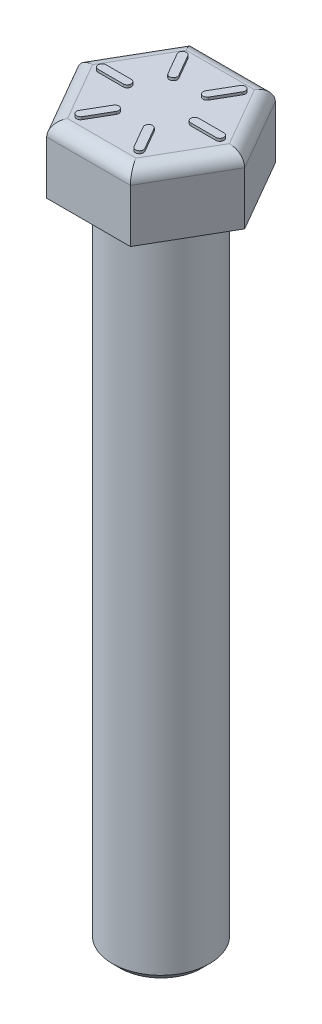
from build123d import *

# Parameters (mm, degrees)
SKETCH1_R           = 4.6609
BOSS_EXTRUDE1_DEPTH = 63.5
BOSS_EXTRUDE2_DEPTH = 6.35
FILLET1_R           = 1.27
CHAMFER1_SIZE       = 0.762
BOSS_EXTRUDE3_DEPTH = 0.254


with BuildPart() as part:
    # Sketch1 → Boss-Extrude1 (new body)
    with BuildSketch(Plane(origin=(0, 0, 0), x_dir=(1, 0, 0), z_dir=(0, 1, 0))):
        with Locations(Location((0, 0, 0), (0, 0, 270))):
            Circle(SKETCH1_R)
    extrude(amount=-BOSS_EXTRUDE1_DEPTH)

    # Sketch2 → Boss-Extrude2 (add)
    with BuildSketch(Plane(origin=(0, 0, 0), x_dir=(1, 0, 0), z_dir=(0, 1, 0))):
        Polygon((8.028921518, 0), (4.014460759, 6.95325), (-4.014460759, 6.95325), (-8.028921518, 0), (-4.014460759, -6.95325), (4.014460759, -6.95325), align=None)
    extrude(amount=BOSS_EXTRUDE2_DEPTH)

    # Fillet1
    fillet1_edges = [part.edges().sort_by_distance(p)[0] for p in [
        (6.021691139, 6.35, 3.476625),
        (6.021691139, 6.35, -3.476625),
        (0, 6.35, -6.95325),
        (-6.021691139, 6.35, -3.476625),
        (-6.021691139, 6.35, 3.476625),
        (0, 6.35, 6.95325),
    ]]
    fillet(fillet1_edges, radius=FILLET1_R)

    # Chamfer1
    chamfer1_edges = [part.edges().sort_by_distance(p)[0] for p in [
        (0, -63.5, -4.6609),
    ]]
    chamfer(chamfer1_edges, length=CHAMFER1_SIZE)

    # Sketch3 → Boss-Extrude3 (add)
    with BuildSketch(Plane(origin=(0, 6.35, 0), x_dir=(1, 0, 0), z_dir=(0, 1, 0))):
        with BuildLine():
            Line((5.6515, -0.381), (3.2385, -0.381))
            ThreePointArc((3.2385, -0.381), (2.8575, 0), (3.2385, 0.381))
            Line((3.2385, 0.381), (5.6515, 0.381))
            ThreePointArc((5.6515, 0.381), (6.0325, 0), (5.6515, -0.381))
        make_face()
        with BuildLine():
            Line((3.155705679, 4.703842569), (1.949205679, 2.61412327))
            ThreePointArc((1.949205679, 2.61412327), (1.42875, 2.474667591), (1.289294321, 2.99512327))
            Line((1.289294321, 2.99512327), (2.495794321, 5.084842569))
            ThreePointArc((2.495794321, 5.084842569), (3.01625, 5.224298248), (3.155705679, 4.703842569))
        make_face()
        with BuildLine():
            Line((-2.495794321, 5.084842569), (-1.289294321, 2.99512327))
            ThreePointArc((-1.289294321, 2.99512327), (-1.42875, 2.474667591), (-1.949205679, 2.61412327))
            Line((-1.949205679, 2.61412327), (-3.155705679, 4.703842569))
            ThreePointArc((-3.155705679, 4.703842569), (-3.01625, 5.224298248), (-2.495794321, 5.084842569))
        make_face()
        with BuildLine():
            Line((-5.6515, 0.381), (-3.2385, 0.381))
            ThreePointArc((-3.2385, 0.381), (-2.8575, 0), (-3.2385, -0.381))
            Line((-3.2385, -0.381), (-5.6515, -0.381))
            ThreePointArc((-5.6515, -0.381), (-6.0325, 0), (-5.6515, 0.381))
        make_face()
        with BuildLine():
            Line((-3.155705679, -4.703842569), (-1.949205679, -2.61412327))
            ThreePointArc((-1.949205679, -2.61412327), (-1.42875, -2.474667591), (-1.289294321, -2.99512327))
            Line((-1.289294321, -2.99512327), (-2.495794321, -5.084842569))
            ThreePointArc((-2.495794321, -5.084842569), (-3.01625, -5.224298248), (-3.155705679, -4.703842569))
        make_face()
        with BuildLine():
            Line((2.495794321, -5.084842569), (1.289294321, -2.99512327))
            ThreePointArc((1.289294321, -2.99512327), (1.42875, -2.474667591), (1.949205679, -2.61412327))
            Line((1.949205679, -2.61412327), (3.155705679, -4.703842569))
            ThreePointArc((3.155705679, -4.703842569), (3.01625, -5.224298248), (2.495794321, -5.084842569))
        make_face()
    extrude(amount=BOSS_EXTRUDE3_DEPTH)


solid = part.part
